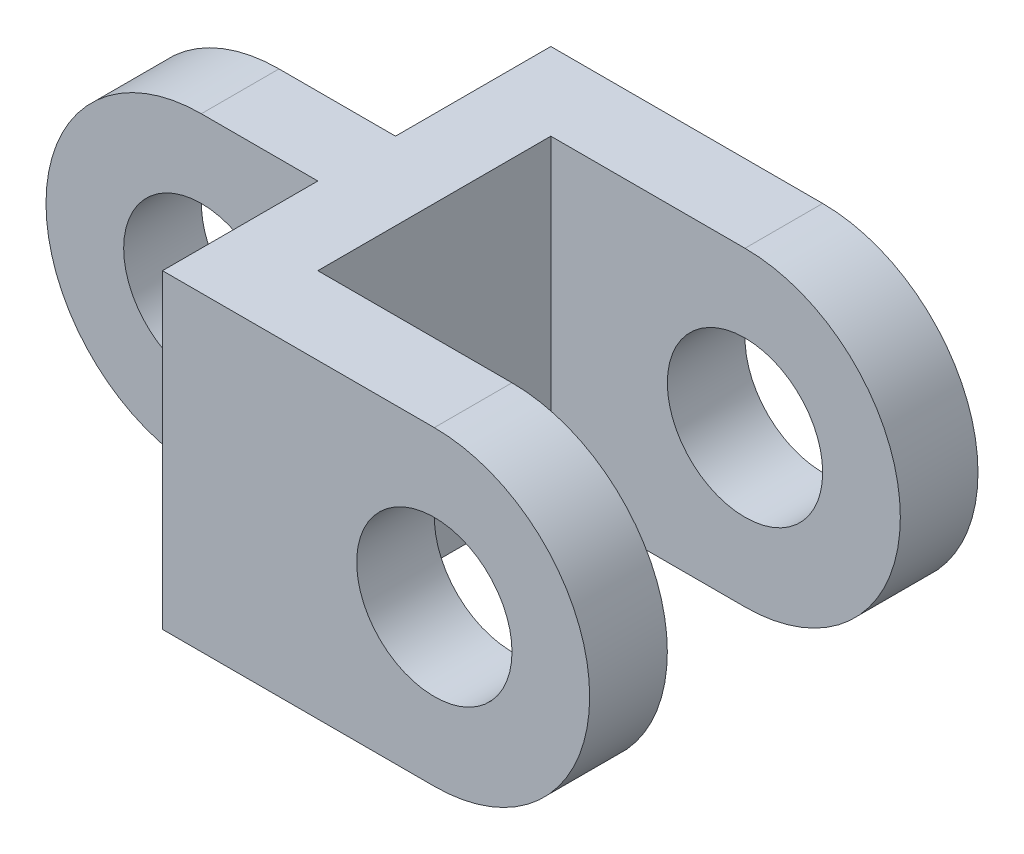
ISO-10303-21;
HEADER;
FILE_DESCRIPTION(('STEP AP214'),'2;1');
FILE_NAME('part.step','',(''),(''),'','','');
FILE_SCHEMA(('AUTOMOTIVE_DESIGN { 1 0 10303 214 1 1 1 1 }'));
ENDSEC;
DATA;
#1=APPLICATION_CONTEXT('core data for automotive mechanical design processes');
#2=APPLICATION_PROTOCOL_DEFINITION('international standard','automotive_design',2000,#1);
#3=PRODUCT_CONTEXT('',#1,'mechanical');
#4=PRODUCT('Part','Part','',(#3));
#5=PRODUCT_RELATED_PRODUCT_CATEGORY('part','',(#4));
#6=PRODUCT_DEFINITION_FORMATION('','',#4);
#7=PRODUCT_DEFINITION_CONTEXT('part definition',#1,'design');
#8=PRODUCT_DEFINITION('design','',#6,#7);
#9=PRODUCT_DEFINITION_SHAPE('','',#8);
#10=(LENGTH_UNIT() NAMED_UNIT(*) SI_UNIT(.MILLI.,.METRE.));
#11=(NAMED_UNIT(*) PLANE_ANGLE_UNIT() SI_UNIT($,.RADIAN.));
#12=(NAMED_UNIT(*) SI_UNIT($,.STERADIAN.) SOLID_ANGLE_UNIT());
#13=UNCERTAINTY_MEASURE_WITH_UNIT(LENGTH_MEASURE(1.E-05),#10,'distance_accuracy_value','');
#14=(GEOMETRIC_REPRESENTATION_CONTEXT(3) GLOBAL_UNCERTAINTY_ASSIGNED_CONTEXT((#13)) GLOBAL_UNIT_ASSIGNED_CONTEXT((#10,
#11,#12)) REPRESENTATION_CONTEXT('',''));
#15=CARTESIAN_POINT('',(0.,0.,0.));
#16=DIRECTION('',(0.,0.,1.));
#17=DIRECTION('',(1.,0.,0.));
#18=AXIS2_PLACEMENT_3D('',#15,#16,#17);
#19=CARTESIAN_POINT('',(20.,20.,-30.));
#20=DIRECTION('',(0.,0.,1.));
#21=DIRECTION('',(1.,0.,0.));
#22=AXIS2_PLACEMENT_3D('',#19,#20,#21);
#23=CYLINDRICAL_SURFACE('',#22,20.);
#24=DIRECTION('',(0.,0.,-1.));
#25=VECTOR('',#24,1.);
#26=CARTESIAN_POINT('',(20.,40.,-30.));
#27=LINE('',#26,#25);
#28=CARTESIAN_POINT('',(20.,40.,-30.));
#29=VERTEX_POINT('',#28);
#30=CARTESIAN_POINT('',(20.,40.,-20.));
#31=VERTEX_POINT('',#30);
#32=EDGE_CURVE('E212',#29,#31,#27,.F.);
#33=ORIENTED_EDGE('',*,*,#32,.F.);
#34=CARTESIAN_POINT('',(20.,20.,-30.));
#35=DIRECTION('',(0.,0.,1.));
#36=DIRECTION('',(1.,0.,0.));
#37=AXIS2_PLACEMENT_3D('',#34,#35,#36);
#38=CIRCLE('',#37,20.);
#39=CARTESIAN_POINT('',(20.,0.,-30.));
#40=VERTEX_POINT('',#39);
#41=EDGE_CURVE('E39',#40,#29,#38,.F.);
#42=ORIENTED_EDGE('',*,*,#41,.F.);
#43=DIRECTION('',(0.,0.,1.));
#44=VECTOR('',#43,1.);
#45=CARTESIAN_POINT('',(20.,0.,-40.));
#46=LINE('',#45,#44);
#47=CARTESIAN_POINT('',(20.,0.,-20.));
#48=VERTEX_POINT('',#47);
#49=EDGE_CURVE('E215',#48,#40,#46,.F.);
#50=ORIENTED_EDGE('',*,*,#49,.F.);
#51=CARTESIAN_POINT('',(20.,20.,-20.));
#52=DIRECTION('',(0.,0.,-1.));
#53=DIRECTION('',(-1.,0.,0.));
#54=AXIS2_PLACEMENT_3D('',#51,#52,#53);
#55=CIRCLE('',#54,20.);
#56=EDGE_CURVE('E11',#31,#48,#55,.F.);
#57=ORIENTED_EDGE('',*,*,#56,.F.);
#58=EDGE_LOOP('',(#33,#42,#50,#57));
#59=FACE_BOUND('',#58,.T.);
#60=ADVANCED_FACE('F31',(#59),#23,.T.);
#61=CARTESIAN_POINT('',(70.,20.,-50.));
#62=DIRECTION('',(0.,0.,-1.));
#63=DIRECTION('',(-1.,0.,0.));
#64=AXIS2_PLACEMENT_3D('',#61,#62,#63);
#65=CYLINDRICAL_SURFACE('',#64,20.);
#66=DIRECTION('',(0.,0.,-1.));
#67=VECTOR('',#66,1.);
#68=CARTESIAN_POINT('',(70.,0.,-40.));
#69=LINE('',#68,#67);
#70=CARTESIAN_POINT('',(70.,0.,-50.));
#71=VERTEX_POINT('',#70);
#72=CARTESIAN_POINT('',(70.,0.,-40.));
#73=VERTEX_POINT('',#72);
#74=EDGE_CURVE('E204',#71,#73,#69,.F.);
#75=ORIENTED_EDGE('',*,*,#74,.F.);
#76=CARTESIAN_POINT('',(70.,20.,-50.));
#77=DIRECTION('',(0.,0.,1.));
#78=DIRECTION('',(1.,0.,0.));
#79=AXIS2_PLACEMENT_3D('',#76,#77,#78);
#80=CIRCLE('',#79,20.);
#81=CARTESIAN_POINT('',(70.,40.,-50.));
#82=VERTEX_POINT('',#81);
#83=EDGE_CURVE('E208',#82,#71,#80,.F.);
#84=ORIENTED_EDGE('',*,*,#83,.F.);
#85=DIRECTION('',(0.,0.,1.));
#86=VECTOR('',#85,1.);
#87=CARTESIAN_POINT('',(70.,40.,-50.));
#88=LINE('',#87,#86);
#89=CARTESIAN_POINT('',(70.,40.,-40.));
#90=VERTEX_POINT('',#89);
#91=EDGE_CURVE('E127',#90,#82,#88,.F.);
#92=ORIENTED_EDGE('',*,*,#91,.F.);
#93=CARTESIAN_POINT('',(70.,20.,-40.));
#94=DIRECTION('',(0.,0.,-1.));
#95=DIRECTION('',(-1.,0.,0.));
#96=AXIS2_PLACEMENT_3D('',#93,#94,#95);
#97=CIRCLE('',#96,20.);
#98=EDGE_CURVE('E210',#73,#90,#97,.F.);
#99=ORIENTED_EDGE('',*,*,#98,.F.);
#100=EDGE_LOOP('',(#75,#84,#92,#99));
#101=FACE_BOUND('',#100,.T.);
#102=ADVANCED_FACE('F252',(#101),#65,.T.);
#103=CARTESIAN_POINT('',(70.,20.,0.));
#104=DIRECTION('',(0.,0.,-1.));
#105=DIRECTION('',(-1.,0.,0.));
#106=AXIS2_PLACEMENT_3D('',#103,#104,#105);
#107=CYLINDRICAL_SURFACE('',#106,20.);
#108=DIRECTION('',(0.,0.,1.));
#109=VECTOR('',#108,1.);
#110=CARTESIAN_POINT('',(70.,40.,0.));
#111=LINE('',#110,#109);
#112=CARTESIAN_POINT('',(70.,40.,0.));
#113=VERTEX_POINT('',#112);
#114=CARTESIAN_POINT('',(70.,40.,-10.));
#115=VERTEX_POINT('',#114);
#116=EDGE_CURVE('E138',#113,#115,#111,.F.);
#117=ORIENTED_EDGE('',*,*,#116,.F.);
#118=CARTESIAN_POINT('',(70.,20.,0.));
#119=DIRECTION('',(0.,0.,-1.));
#120=DIRECTION('',(-1.,0.,0.));
#121=AXIS2_PLACEMENT_3D('',#118,#119,#120);
#122=CIRCLE('',#121,20.);
#123=CARTESIAN_POINT('',(70.,0.,0.));
#124=VERTEX_POINT('',#123);
#125=EDGE_CURVE('E200',#124,#113,#122,.F.);
#126=ORIENTED_EDGE('',*,*,#125,.F.);
#127=DIRECTION('',(0.,0.,-1.));
#128=VECTOR('',#127,1.);
#129=CARTESIAN_POINT('',(70.,0.,-40.));
#130=LINE('',#129,#128);
#131=CARTESIAN_POINT('',(70.,0.,-10.));
#132=VERTEX_POINT('',#131);
#133=EDGE_CURVE('E197',#132,#124,#130,.F.);
#134=ORIENTED_EDGE('',*,*,#133,.F.);
#135=CARTESIAN_POINT('',(70.,20.,-10.));
#136=DIRECTION('',(0.,0.,1.));
#137=DIRECTION('',(1.,0.,0.));
#138=AXIS2_PLACEMENT_3D('',#135,#136,#137);
#139=CIRCLE('',#138,20.);
#140=EDGE_CURVE('E202',#115,#132,#139,.F.);
#141=ORIENTED_EDGE('',*,*,#140,.F.);
#142=EDGE_LOOP('',(#117,#126,#134,#141));
#143=FACE_BOUND('',#142,.T.);
#144=ADVANCED_FACE('F256',(#143),#107,.T.);
#145=CARTESIAN_POINT('',(35.,40.,-50.));
#146=DIRECTION('',(0.,0.,1.));
#147=DIRECTION('',(1.,0.,0.));
#148=AXIS2_PLACEMENT_3D('',#145,#146,#147);
#149=PLANE('',#148);
#150=CARTESIAN_POINT('',(70.,20.,-50.));
#151=DIRECTION('',(0.,0.,1.));
#152=DIRECTION('',(1.,0.,0.));
#153=AXIS2_PLACEMENT_3D('',#150,#151,#152);
#154=CIRCLE('',#153,9.99999999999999);
#155=CARTESIAN_POINT('',(80.,20.,-50.));
#156=VERTEX_POINT('',#155);
#157=EDGE_CURVE('E219',#156,#156,#154,.T.);
#158=ORIENTED_EDGE('',*,*,#157,.T.);
#159=EDGE_LOOP('',(#158));
#160=FACE_BOUND('',#159,.T.);
#161=DIRECTION('',(-1.,0.,0.));
#162=VECTOR('',#161,1.);
#163=CARTESIAN_POINT('',(35.,40.,-50.));
#164=LINE('',#163,#162);
#165=CARTESIAN_POINT('',(35.,40.,-50.));
#166=VERTEX_POINT('',#165);
#167=EDGE_CURVE('E118',#82,#166,#164,.T.);
#168=ORIENTED_EDGE('',*,*,#167,.F.);
#169=ORIENTED_EDGE('',*,*,#83,.T.);
#170=DIRECTION('',(-1.,0.,0.));
#171=VECTOR('',#170,1.);
#172=CARTESIAN_POINT('',(35.,0.,-50.));
#173=LINE('',#172,#171);
#174=CARTESIAN_POINT('',(35.,0.,-50.));
#175=VERTEX_POINT('',#174);
#176=EDGE_CURVE('E135',#71,#175,#173,.T.);
#177=ORIENTED_EDGE('',*,*,#176,.T.);
#178=DIRECTION('',(0.,-1.,0.));
#179=VECTOR('',#178,1.);
#180=CARTESIAN_POINT('',(35.,40.,-50.));
#181=LINE('',#180,#179);
#182=EDGE_CURVE('E132',#166,#175,#181,.T.);
#183=ORIENTED_EDGE('',*,*,#182,.F.);
#184=EDGE_LOOP('',(#168,#169,#177,#183));
#185=FACE_BOUND('',#184,.T.);
#186=ADVANCED_FACE('F133',(#160,#185),#149,.F.);
#187=CARTESIAN_POINT('',(35.,40.,-30.));
#188=DIRECTION('',(1.,0.,0.));
#189=DIRECTION('',(0.,0.,-1.));
#190=AXIS2_PLACEMENT_3D('',#187,#188,#189);
#191=PLANE('',#190);
#192=DIRECTION('',(0.,0.,1.));
#193=VECTOR('',#192,1.);
#194=CARTESIAN_POINT('',(35.,0.,-30.));
#195=LINE('',#194,#193);
#196=CARTESIAN_POINT('',(35.,0.,-30.));
#197=VERTEX_POINT('',#196);
#198=EDGE_CURVE('E164',#175,#197,#195,.T.);
#199=ORIENTED_EDGE('',*,*,#198,.T.);
#200=DIRECTION('',(0.,-1.,0.));
#201=VECTOR('',#200,1.);
#202=CARTESIAN_POINT('',(35.,40.,-30.));
#203=LINE('',#202,#201);
#204=CARTESIAN_POINT('',(35.,40.,-30.));
#205=VERTEX_POINT('',#204);
#206=EDGE_CURVE('E139',#205,#197,#203,.T.);
#207=ORIENTED_EDGE('',*,*,#206,.F.);
#208=DIRECTION('',(0.,0.,1.));
#209=VECTOR('',#208,1.);
#210=CARTESIAN_POINT('',(35.,40.,-30.));
#211=LINE('',#210,#209);
#212=EDGE_CURVE('E123',#166,#205,#211,.T.);
#213=ORIENTED_EDGE('',*,*,#212,.F.);
#214=ORIENTED_EDGE('',*,*,#182,.T.);
#215=EDGE_LOOP('',(#199,#207,#213,#214));
#216=FACE_BOUND('',#215,.T.);
#217=ADVANCED_FACE('F141',(#216),#191,.F.);
#218=CARTESIAN_POINT('',(0.,40.,-30.));
#219=DIRECTION('',(0.,0.,1.));
#220=DIRECTION('',(1.,0.,0.));
#221=AXIS2_PLACEMENT_3D('',#218,#219,#220);
#222=PLANE('',#221);
#223=CARTESIAN_POINT('',(20.,20.,-30.));
#224=DIRECTION('',(0.,0.,1.));
#225=DIRECTION('',(1.,0.,0.));
#226=AXIS2_PLACEMENT_3D('',#223,#224,#225);
#227=CIRCLE('',#226,10.);
#228=CARTESIAN_POINT('',(30.,20.,-30.));
#229=VERTEX_POINT('',#228);
#230=EDGE_CURVE('E229',#229,#229,#227,.T.);
#231=ORIENTED_EDGE('',*,*,#230,.T.);
#232=EDGE_LOOP('',(#231));
#233=FACE_BOUND('',#232,.T.);
#234=DIRECTION('',(-1.,0.,0.));
#235=VECTOR('',#234,1.);
#236=CARTESIAN_POINT('',(0.,0.,-30.));
#237=LINE('',#236,#235);
#238=EDGE_CURVE('E167',#197,#40,#237,.T.);
#239=ORIENTED_EDGE('',*,*,#238,.T.);
#240=ORIENTED_EDGE('',*,*,#41,.T.);
#241=DIRECTION('',(-1.,0.,0.));
#242=VECTOR('',#241,1.);
#243=CARTESIAN_POINT('',(0.,40.,-30.));
#244=LINE('',#243,#242);
#245=EDGE_CURVE('E144',#205,#29,#244,.T.);
#246=ORIENTED_EDGE('',*,*,#245,.F.);
#247=ORIENTED_EDGE('',*,*,#206,.T.);
#248=EDGE_LOOP('',(#239,#240,#246,#247));
#249=FACE_BOUND('',#248,.T.);
#250=ADVANCED_FACE('F259',(#233,#249),#222,.F.);
#251=CARTESIAN_POINT('',(0.,40.,-20.));
#252=DIRECTION('',(0.,0.,-1.));
#253=DIRECTION('',(-1.,0.,0.));
#254=AXIS2_PLACEMENT_3D('',#251,#252,#253);
#255=PLANE('',#254);
#256=CARTESIAN_POINT('',(20.,20.,-20.));
#257=DIRECTION('',(0.,0.,-1.));
#258=DIRECTION('',(-1.,0.,0.));
#259=AXIS2_PLACEMENT_3D('',#256,#257,#258);
#260=CIRCLE('',#259,10.);
#261=CARTESIAN_POINT('',(10.,20.,-20.));
#262=VERTEX_POINT('',#261);
#263=EDGE_CURVE('E34',#262,#262,#260,.T.);
#264=ORIENTED_EDGE('',*,*,#263,.T.);
#265=EDGE_LOOP('',(#264));
#266=FACE_BOUND('',#265,.T.);
#267=DIRECTION('',(1.,0.,0.));
#268=VECTOR('',#267,1.);
#269=CARTESIAN_POINT('',(0.,40.,-20.));
#270=LINE('',#269,#268);
#271=CARTESIAN_POINT('',(35.,40.,-20.));
#272=VERTEX_POINT('',#271);
#273=EDGE_CURVE('E146',#31,#272,#270,.T.);
#274=ORIENTED_EDGE('',*,*,#273,.F.);
#275=ORIENTED_EDGE('',*,*,#56,.T.);
#276=DIRECTION('',(1.,0.,0.));
#277=VECTOR('',#276,1.);
#278=CARTESIAN_POINT('',(0.,0.,-20.));
#279=LINE('',#278,#277);
#280=CARTESIAN_POINT('',(35.,0.,-20.));
#281=VERTEX_POINT('',#280);
#282=EDGE_CURVE('E170',#48,#281,#279,.T.);
#283=ORIENTED_EDGE('',*,*,#282,.T.);
#284=DIRECTION('',(0.,-1.,0.));
#285=VECTOR('',#284,1.);
#286=CARTESIAN_POINT('',(35.,40.,-20.));
#287=LINE('',#286,#285);
#288=EDGE_CURVE('E191',#272,#281,#287,.T.);
#289=ORIENTED_EDGE('',*,*,#288,.F.);
#290=EDGE_LOOP('',(#274,#275,#283,#289));
#291=FACE_BOUND('',#290,.T.);
#292=ADVANCED_FACE('F238',(#266,#291),#255,.F.);
#293=CARTESIAN_POINT('',(35.,40.,-20.));
#294=DIRECTION('',(1.,0.,0.));
#295=DIRECTION('',(0.,0.,-1.));
#296=AXIS2_PLACEMENT_3D('',#293,#294,#295);
#297=PLANE('',#296);
#298=DIRECTION('',(0.,0.,1.));
#299=VECTOR('',#298,1.);
#300=CARTESIAN_POINT('',(35.,0.,-20.));
#301=LINE('',#300,#299);
#302=CARTESIAN_POINT('',(35.,0.,0.));
#303=VERTEX_POINT('',#302);
#304=EDGE_CURVE('E172',#281,#303,#301,.T.);
#305=ORIENTED_EDGE('',*,*,#304,.T.);
#306=DIRECTION('',(0.,-1.,0.));
#307=VECTOR('',#306,1.);
#308=CARTESIAN_POINT('',(35.,40.,0.));
#309=LINE('',#308,#307);
#310=CARTESIAN_POINT('',(35.,40.,0.));
#311=VERTEX_POINT('',#310);
#312=EDGE_CURVE('E188',#311,#303,#309,.T.);
#313=ORIENTED_EDGE('',*,*,#312,.F.);
#314=DIRECTION('',(0.,0.,1.));
#315=VECTOR('',#314,1.);
#316=CARTESIAN_POINT('',(35.,40.,-20.));
#317=LINE('',#316,#315);
#318=EDGE_CURVE('E151',#272,#311,#317,.T.);
#319=ORIENTED_EDGE('',*,*,#318,.F.);
#320=ORIENTED_EDGE('',*,*,#288,.T.);
#321=EDGE_LOOP('',(#305,#313,#319,#320));
#322=FACE_BOUND('',#321,.T.);
#323=ADVANCED_FACE('F269',(#322),#297,.F.);
#324=CARTESIAN_POINT('',(35.,40.,0.));
#325=DIRECTION('',(0.,0.,-1.));
#326=DIRECTION('',(-1.,0.,0.));
#327=AXIS2_PLACEMENT_3D('',#324,#325,#326);
#328=PLANE('',#327);
#329=CARTESIAN_POINT('',(70.,20.,0.));
#330=DIRECTION('',(0.,0.,1.));
#331=DIRECTION('',(1.,0.,0.));
#332=AXIS2_PLACEMENT_3D('',#329,#330,#331);
#333=CIRCLE('',#332,9.99999999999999);
#334=CARTESIAN_POINT('',(80.,20.,0.));
#335=VERTEX_POINT('',#334);
#336=EDGE_CURVE('E224',#335,#335,#333,.T.);
#337=ORIENTED_EDGE('',*,*,#336,.F.);
#338=EDGE_LOOP('',(#337));
#339=FACE_BOUND('',#338,.T.);
#340=DIRECTION('',(1.,0.,0.));
#341=VECTOR('',#340,1.);
#342=CARTESIAN_POINT('',(35.,0.,0.));
#343=LINE('',#342,#341);
#344=EDGE_CURVE('E174',#303,#124,#343,.T.);
#345=ORIENTED_EDGE('',*,*,#344,.T.);
#346=ORIENTED_EDGE('',*,*,#125,.T.);
#347=DIRECTION('',(1.,0.,0.));
#348=VECTOR('',#347,1.);
#349=CARTESIAN_POINT('',(35.,40.,0.));
#350=LINE('',#349,#348);
#351=EDGE_CURVE('E153',#311,#113,#350,.T.);
#352=ORIENTED_EDGE('',*,*,#351,.F.);
#353=ORIENTED_EDGE('',*,*,#312,.T.);
#354=EDGE_LOOP('',(#345,#346,#352,#353));
#355=FACE_BOUND('',#354,.T.);
#356=ADVANCED_FACE('F275',(#339,#355),#328,.F.);
#357=CARTESIAN_POINT('',(45.,40.,-10.));
#358=DIRECTION('',(0.,0.,1.));
#359=DIRECTION('',(1.,0.,0.));
#360=AXIS2_PLACEMENT_3D('',#357,#358,#359);
#361=PLANE('',#360);
#362=CARTESIAN_POINT('',(70.,20.,-10.));
#363=DIRECTION('',(0.,0.,1.));
#364=DIRECTION('',(1.,0.,0.));
#365=AXIS2_PLACEMENT_3D('',#362,#363,#364);
#366=CIRCLE('',#365,9.99999999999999);
#367=CARTESIAN_POINT('',(80.,20.,-10.));
#368=VERTEX_POINT('',#367);
#369=EDGE_CURVE('E165',#368,#368,#366,.T.);
#370=ORIENTED_EDGE('',*,*,#369,.T.);
#371=EDGE_LOOP('',(#370));
#372=FACE_BOUND('',#371,.T.);
#373=DIRECTION('',(-1.,0.,0.));
#374=VECTOR('',#373,1.);
#375=CARTESIAN_POINT('',(45.,40.,-10.));
#376=LINE('',#375,#374);
#377=CARTESIAN_POINT('',(45.,40.,-10.));
#378=VERTEX_POINT('',#377);
#379=EDGE_CURVE('E156',#115,#378,#376,.T.);
#380=ORIENTED_EDGE('',*,*,#379,.F.);
#381=ORIENTED_EDGE('',*,*,#140,.T.);
#382=DIRECTION('',(-1.,0.,0.));
#383=VECTOR('',#382,1.);
#384=CARTESIAN_POINT('',(45.,0.,-10.));
#385=LINE('',#384,#383);
#386=CARTESIAN_POINT('',(45.,0.,-10.));
#387=VERTEX_POINT('',#386);
#388=EDGE_CURVE('E177',#132,#387,#385,.T.);
#389=ORIENTED_EDGE('',*,*,#388,.T.);
#390=DIRECTION('',(0.,-1.,0.));
#391=VECTOR('',#390,1.);
#392=CARTESIAN_POINT('',(45.,40.,-10.));
#393=LINE('',#392,#391);
#394=EDGE_CURVE('E185',#378,#387,#393,.T.);
#395=ORIENTED_EDGE('',*,*,#394,.F.);
#396=EDGE_LOOP('',(#380,#381,#389,#395));
#397=FACE_BOUND('',#396,.T.);
#398=ADVANCED_FACE('F280',(#372,#397),#361,.F.);
#399=CARTESIAN_POINT('',(45.,40.,-40.));
#400=DIRECTION('',(-1.,0.,0.));
#401=DIRECTION('',(0.,0.,1.));
#402=AXIS2_PLACEMENT_3D('',#399,#400,#401);
#403=PLANE('',#402);
#404=DIRECTION('',(0.,0.,-1.));
#405=VECTOR('',#404,1.);
#406=CARTESIAN_POINT('',(45.,0.,-40.));
#407=LINE('',#406,#405);
#408=CARTESIAN_POINT('',(45.,0.,-40.));
#409=VERTEX_POINT('',#408);
#410=EDGE_CURVE('E179',#387,#409,#407,.T.);
#411=ORIENTED_EDGE('',*,*,#410,.T.);
#412=DIRECTION('',(0.,-1.,0.));
#413=VECTOR('',#412,1.);
#414=CARTESIAN_POINT('',(45.,40.,-40.));
#415=LINE('',#414,#413);
#416=CARTESIAN_POINT('',(45.,40.,-40.));
#417=VERTEX_POINT('',#416);
#418=EDGE_CURVE('E162',#417,#409,#415,.T.);
#419=ORIENTED_EDGE('',*,*,#418,.F.);
#420=DIRECTION('',(0.,0.,-1.));
#421=VECTOR('',#420,1.);
#422=CARTESIAN_POINT('',(45.,40.,-40.));
#423=LINE('',#422,#421);
#424=EDGE_CURVE('E158',#378,#417,#423,.T.);
#425=ORIENTED_EDGE('',*,*,#424,.F.);
#426=ORIENTED_EDGE('',*,*,#394,.T.);
#427=EDGE_LOOP('',(#411,#419,#425,#426));
#428=FACE_BOUND('',#427,.T.);
#429=ADVANCED_FACE('F286',(#428),#403,.F.);
#430=CARTESIAN_POINT('',(45.,40.,-40.));
#431=DIRECTION('',(0.,0.,-1.));
#432=DIRECTION('',(-1.,0.,0.));
#433=AXIS2_PLACEMENT_3D('',#430,#431,#432);
#434=PLANE('',#433);
#435=CARTESIAN_POINT('',(70.,20.,-40.));
#436=DIRECTION('',(0.,0.,-1.));
#437=DIRECTION('',(-1.,0.,0.));
#438=AXIS2_PLACEMENT_3D('',#435,#436,#437);
#439=CIRCLE('',#438,9.99999999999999);
#440=CARTESIAN_POINT('',(60.,20.,-40.));
#441=VERTEX_POINT('',#440);
#442=EDGE_CURVE('E217',#441,#441,#439,.T.);
#443=ORIENTED_EDGE('',*,*,#442,.T.);
#444=EDGE_LOOP('',(#443));
#445=FACE_BOUND('',#444,.T.);
#446=DIRECTION('',(1.,0.,0.));
#447=VECTOR('',#446,1.);
#448=CARTESIAN_POINT('',(45.,0.,-40.));
#449=LINE('',#448,#447);
#450=EDGE_CURVE('E129',#409,#73,#449,.T.);
#451=ORIENTED_EDGE('',*,*,#450,.T.);
#452=ORIENTED_EDGE('',*,*,#98,.T.);
#453=DIRECTION('',(1.,0.,0.));
#454=VECTOR('',#453,1.);
#455=CARTESIAN_POINT('',(45.,40.,-40.));
#456=LINE('',#455,#454);
#457=EDGE_CURVE('E160',#417,#90,#456,.T.);
#458=ORIENTED_EDGE('',*,*,#457,.F.);
#459=ORIENTED_EDGE('',*,*,#418,.T.);
#460=EDGE_LOOP('',(#451,#452,#458,#459));
#461=FACE_BOUND('',#460,.T.);
#462=ADVANCED_FACE('F290',(#445,#461),#434,.F.);
#463=CARTESIAN_POINT('',(90.,40.,-40.));
#464=DIRECTION('',(0.,1.,0.));
#465=DIRECTION('',(0.,0.,1.));
#466=AXIS2_PLACEMENT_3D('',#463,#464,#465);
#467=PLANE('',#466);
#468=ORIENTED_EDGE('',*,*,#245,.T.);
#469=ORIENTED_EDGE('',*,*,#32,.T.);
#470=ORIENTED_EDGE('',*,*,#273,.T.);
#471=ORIENTED_EDGE('',*,*,#318,.T.);
#472=ORIENTED_EDGE('',*,*,#351,.T.);
#473=ORIENTED_EDGE('',*,*,#116,.T.);
#474=ORIENTED_EDGE('',*,*,#379,.T.);
#475=ORIENTED_EDGE('',*,*,#424,.T.);
#476=ORIENTED_EDGE('',*,*,#457,.T.);
#477=ORIENTED_EDGE('',*,*,#91,.T.);
#478=ORIENTED_EDGE('',*,*,#167,.T.);
#479=ORIENTED_EDGE('',*,*,#212,.T.);
#480=EDGE_LOOP('',(#468,#469,#470,#471,#472,#473,#474,#475,#476,#477,#478,#479));
#481=FACE_BOUND('',#480,.T.);
#482=ADVANCED_FACE('F121',(#481),#467,.T.);
#483=CARTESIAN_POINT('',(90.,0.,-40.));
#484=DIRECTION('',(0.,1.,0.));
#485=DIRECTION('',(0.,0.,1.));
#486=AXIS2_PLACEMENT_3D('',#483,#484,#485);
#487=PLANE('',#486);
#488=ORIENTED_EDGE('',*,*,#282,.F.);
#489=ORIENTED_EDGE('',*,*,#49,.T.);
#490=ORIENTED_EDGE('',*,*,#238,.F.);
#491=ORIENTED_EDGE('',*,*,#198,.F.);
#492=ORIENTED_EDGE('',*,*,#176,.F.);
#493=ORIENTED_EDGE('',*,*,#74,.T.);
#494=ORIENTED_EDGE('',*,*,#450,.F.);
#495=ORIENTED_EDGE('',*,*,#410,.F.);
#496=ORIENTED_EDGE('',*,*,#388,.F.);
#497=ORIENTED_EDGE('',*,*,#133,.T.);
#498=ORIENTED_EDGE('',*,*,#344,.F.);
#499=ORIENTED_EDGE('',*,*,#304,.F.);
#500=EDGE_LOOP('',(#488,#489,#490,#491,#492,#493,#494,#495,#496,#497,#498,#499));
#501=FACE_BOUND('',#500,.T.);
#502=ADVANCED_FACE('F263',(#501),#487,.F.);
#503=CARTESIAN_POINT('',(70.,20.,-50.));
#504=DIRECTION('',(0.,0.,1.));
#505=DIRECTION('',(1.,0.,0.));
#506=AXIS2_PLACEMENT_3D('',#503,#504,#505);
#507=CYLINDRICAL_SURFACE('',#506,9.99999999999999);
#508=ORIENTED_EDGE('',*,*,#157,.F.);
#509=EDGE_LOOP('',(#508));
#510=FACE_BOUND('',#509,.T.);
#511=ORIENTED_EDGE('',*,*,#442,.F.);
#512=EDGE_LOOP('',(#511));
#513=FACE_BOUND('',#512,.T.);
#514=ADVANCED_FACE('F248',(#510,#513),#507,.F.);
#515=ORIENTED_EDGE('',*,*,#336,.T.);
#516=EDGE_LOOP('',(#515));
#517=FACE_BOUND('',#516,.T.);
#518=ORIENTED_EDGE('',*,*,#369,.F.);
#519=EDGE_LOOP('',(#518));
#520=FACE_BOUND('',#519,.T.);
#521=ADVANCED_FACE('F243',(#517,#520),#507,.F.);
#522=CARTESIAN_POINT('',(20.,20.,-50.));
#523=DIRECTION('',(0.,0.,1.));
#524=DIRECTION('',(1.,0.,0.));
#525=AXIS2_PLACEMENT_3D('',#522,#523,#524);
#526=CYLINDRICAL_SURFACE('',#525,10.);
#527=ORIENTED_EDGE('',*,*,#263,.F.);
#528=EDGE_LOOP('',(#527));
#529=FACE_BOUND('',#528,.T.);
#530=ORIENTED_EDGE('',*,*,#230,.F.);
#531=EDGE_LOOP('',(#530));
#532=FACE_BOUND('',#531,.T.);
#533=ADVANCED_FACE('F240',(#529,#532),#526,.F.);
#534=CLOSED_SHELL('',(#60,#102,#144,#186,#217,#250,#292,#323,#356,#398,#429,#462,#482,#502,#514,
#521,#533));
#535=MANIFOLD_SOLID_BREP('B2',#534);
#536=ADVANCED_BREP_SHAPE_REPRESENTATION('',(#18,#535),#14);
#537=SHAPE_DEFINITION_REPRESENTATION(#9,#536);
ENDSEC;
END-ISO-10303-21;
